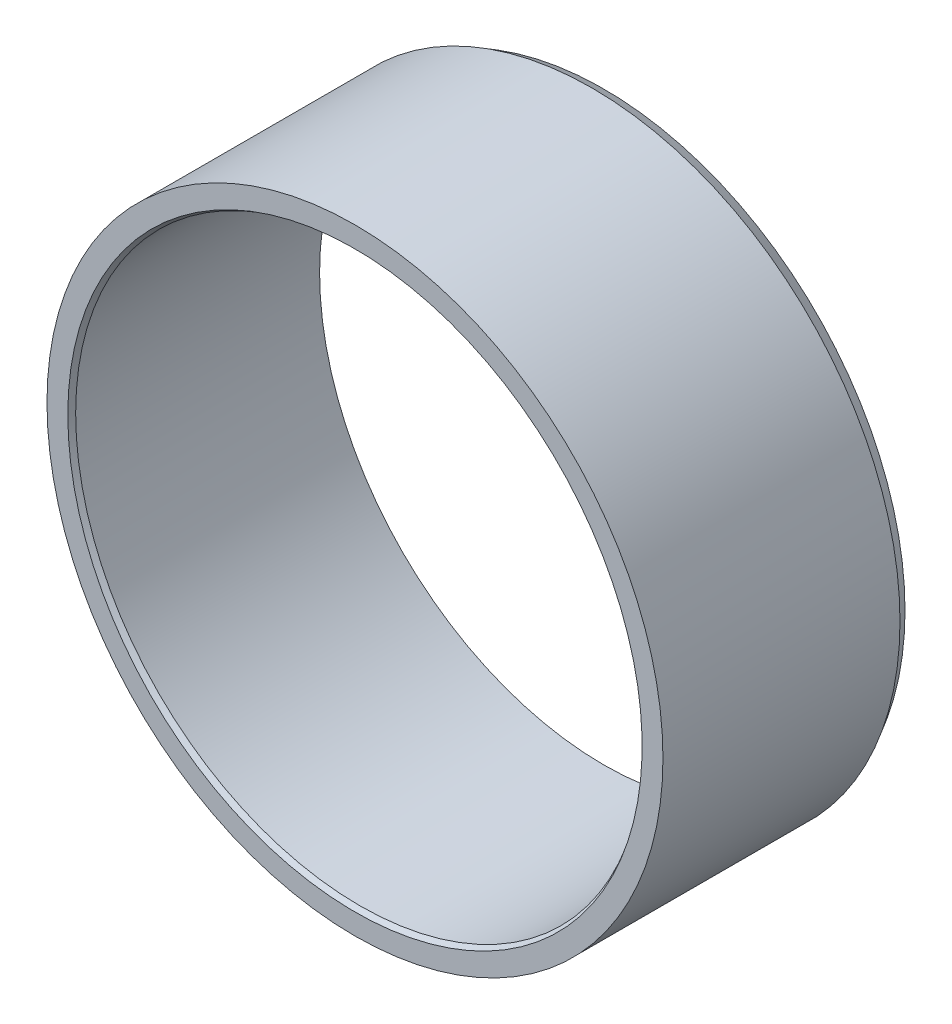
from build123d import *

# Parameters (mm, degrees)
SKETCH1_W      = 25.019
SKETCH1_H      = 2.38125
CHAMFER1_SIZE  = 0.50038
CHAMFER1_SIZE2 = 0.288894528
CHAMFER2_SIZE  = 1.1938
CHAMFER2_SIZE2 = 0.689240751


with BuildPart() as part:
    # Sketch1 → Revolve1 (revolve)
    with BuildSketch(Plane(origin=(0, 0, 0), x_dir=(0, 0, -1), z_dir=(1, 0, 0)), mode=Mode.PRIVATE) as revolve1_sk:
        with Locations((0, 29.765625)):
            Rectangle(SKETCH1_W, SKETCH1_H)
    revolve(revolve1_sk.sketch.rotate(Axis((0, 0, 0), (0, 0, -1)), 90), axis=Axis((0, 0, 0), (0, 0, -1)))

    # Chamfer1
    chamfer1_edges = [part.edges().sort_by_distance(p)[0] for p in [
        (-28.575, 0, 12.5095),
    ]]
    chamfer1_side = [part.faces().sort_by_distance(p)[0] for p in [
        (-28.575, 0, 0),
    ]]
    chamfer(chamfer1_edges, length=CHAMFER1_SIZE, length2=CHAMFER1_SIZE2, reference=chamfer1_side[0])

    # Chamfer2
    chamfer2_edges = [part.edges().sort_by_distance(p)[0] for p in [
        (-30.95625, 0, -12.5095),
    ]]
    chamfer2_side = [part.faces().sort_by_distance(p)[0] for p in [
        (-30.95625, 0, 0),
    ]]
    chamfer(chamfer2_edges, length=CHAMFER2_SIZE, length2=CHAMFER2_SIZE2, reference=chamfer2_side[0])


solid = part.part
